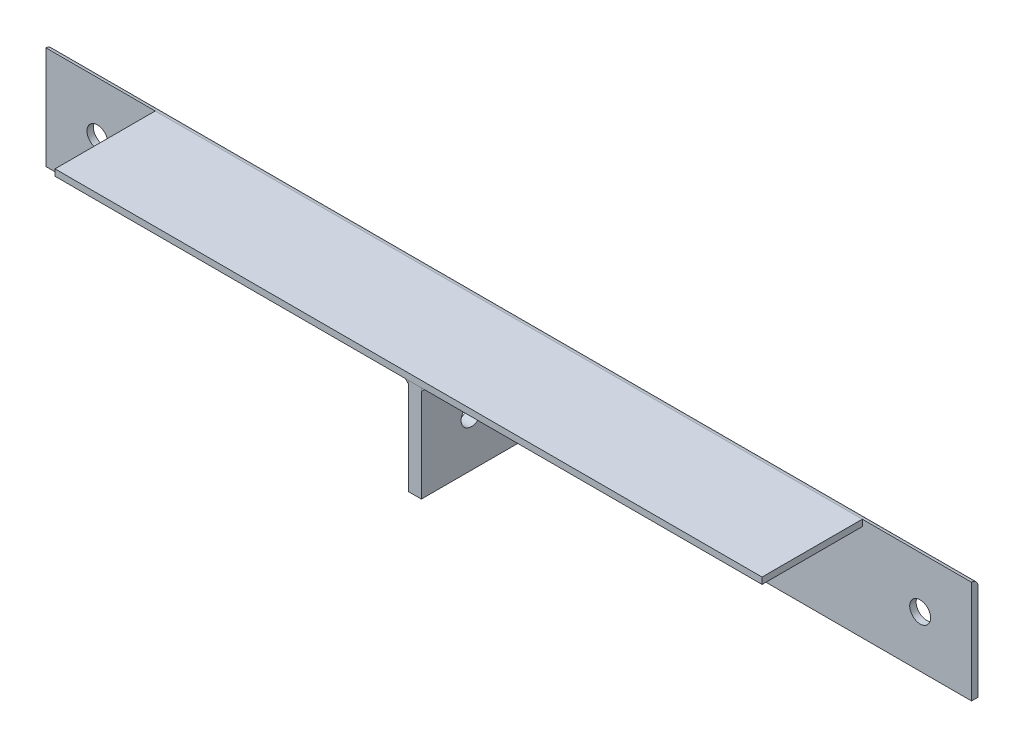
ISO-10303-21;
HEADER;
FILE_DESCRIPTION(('STEP AP214'),'2;1');
FILE_NAME('part.step','',(''),(''),'','','');
FILE_SCHEMA(('AUTOMOTIVE_DESIGN { 1 0 10303 214 1 1 1 1 }'));
ENDSEC;
DATA;
#1=APPLICATION_CONTEXT('core data for automotive mechanical design processes');
#2=APPLICATION_PROTOCOL_DEFINITION('international standard','automotive_design',2000,#1);
#3=PRODUCT_CONTEXT('',#1,'mechanical');
#4=PRODUCT('Part','Part','',(#3));
#5=PRODUCT_RELATED_PRODUCT_CATEGORY('part','',(#4));
#6=PRODUCT_DEFINITION_FORMATION('','',#4);
#7=PRODUCT_DEFINITION_CONTEXT('part definition',#1,'design');
#8=PRODUCT_DEFINITION('design','',#6,#7);
#9=PRODUCT_DEFINITION_SHAPE('','',#8);
#10=(LENGTH_UNIT() NAMED_UNIT(*) SI_UNIT(.MILLI.,.METRE.));
#11=(NAMED_UNIT(*) PLANE_ANGLE_UNIT() SI_UNIT($,.RADIAN.));
#12=(NAMED_UNIT(*) SI_UNIT($,.STERADIAN.) SOLID_ANGLE_UNIT());
#13=UNCERTAINTY_MEASURE_WITH_UNIT(LENGTH_MEASURE(1.E-05),#10,'distance_accuracy_value','');
#14=(GEOMETRIC_REPRESENTATION_CONTEXT(3) GLOBAL_UNCERTAINTY_ASSIGNED_CONTEXT((#13)) GLOBAL_UNIT_ASSIGNED_CONTEXT((#10,
#11,#12)) REPRESENTATION_CONTEXT('',''));
#15=CARTESIAN_POINT('',(0.,0.,0.));
#16=DIRECTION('',(0.,0.,1.));
#17=DIRECTION('',(1.,0.,0.));
#18=AXIS2_PLACEMENT_3D('',#15,#16,#17);
#19=CARTESIAN_POINT('',(0.,-101.6,6.35));
#20=DIRECTION('',(0.,1.,0.));
#21=DIRECTION('',(-1.,0.,0.));
#22=AXIS2_PLACEMENT_3D('',#19,#20,#21);
#23=PLANE('',#22);
#24=DIRECTION('',(1.,0.,0.));
#25=VECTOR('',#24,1.);
#26=CARTESIAN_POINT('',(0.,-101.6,6.35));
#27=LINE('',#26,#25);
#28=CARTESIAN_POINT('',(-444.5,-101.6,6.35));
#29=VERTEX_POINT('',#28);
#30=CARTESIAN_POINT('',(-441.325,-101.6,6.35));
#31=VERTEX_POINT('',#30);
#32=EDGE_CURVE('E47',#29,#31,#27,.T.);
#33=ORIENTED_EDGE('',*,*,#32,.T.);
#34=DIRECTION('',(0.707106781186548,0.,-0.707106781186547));
#35=VECTOR('',#34,1.);
#36=CARTESIAN_POINT('',(-220.6625,-101.6,-214.3125));
#37=LINE('',#36,#35);
#38=CARTESIAN_POINT('',(-444.5,-101.6,9.52499999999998));
#39=VERTEX_POINT('',#38);
#40=EDGE_CURVE('E117',#31,#39,#37,.F.);
#41=ORIENTED_EDGE('',*,*,#40,.T.);
#42=DIRECTION('',(0.,0.,-1.));
#43=VECTOR('',#42,1.);
#44=CARTESIAN_POINT('',(-444.5,-101.6,105.41));
#45=LINE('',#44,#43);
#46=EDGE_CURVE('E62',#39,#29,#45,.T.);
#47=ORIENTED_EDGE('',*,*,#46,.T.);
#48=EDGE_LOOP('',(#33,#41,#47));
#49=FACE_BOUND('',#48,.T.);
#50=ADVANCED_FACE('F43',(#49),#23,.F.);
#51=CARTESIAN_POINT('',(-107.95,-6.35,105.41));
#52=DIRECTION('',(0.,0.,-1.));
#53=DIRECTION('',(-1.,0.,0.));
#54=AXIS2_PLACEMENT_3D('',#51,#52,#53);
#55=PLANE('',#54);
#56=DIRECTION('',(-0.707106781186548,-0.707106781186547,0.));
#57=VECTOR('',#56,1.);
#58=CARTESIAN_POINT('',(-274.6375,160.3375,105.41));
#59=LINE('',#58,#57);
#60=CARTESIAN_POINT('',(-444.5,-9.52499999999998,105.41));
#61=VERTEX_POINT('',#60);
#62=CARTESIAN_POINT('',(-441.325,-6.35,105.41));
#63=VERTEX_POINT('',#62);
#64=EDGE_CURVE('E105',#61,#63,#59,.F.);
#65=ORIENTED_EDGE('',*,*,#64,.T.);
#66=DIRECTION('',(-1.,0.,0.));
#67=VECTOR('',#66,1.);
#68=CARTESIAN_POINT('',(-107.95,-6.35,105.41));
#69=LINE('',#68,#67);
#70=CARTESIAN_POINT('',(-444.5,-6.35,105.41));
#71=VERTEX_POINT('',#70);
#72=EDGE_CURVE('E114',#63,#71,#69,.T.);
#73=ORIENTED_EDGE('',*,*,#72,.T.);
#74=DIRECTION('',(0.,1.,0.));
#75=VECTOR('',#74,1.);
#76=CARTESIAN_POINT('',(-444.5,-6.35,105.41));
#77=LINE('',#76,#75);
#78=EDGE_CURVE('E12',#61,#71,#77,.T.);
#79=ORIENTED_EDGE('',*,*,#78,.F.);
#80=EDGE_LOOP('',(#65,#73,#79));
#81=FACE_BOUND('',#80,.T.);
#82=ADVANCED_FACE('F135',(#81),#55,.F.);
#83=CARTESIAN_POINT('',(-444.5,-101.6,9.52499999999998));
#84=DIRECTION('',(0.707106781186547,0.,0.707106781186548));
#85=DIRECTION('',(0.707106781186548,0.,-0.707106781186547));
#86=AXIS2_PLACEMENT_3D('',#83,#84,#85);
#87=PLANE('',#86);
#88=ORIENTED_EDGE('',*,*,#40,.F.);
#89=DIRECTION('',(0.,-1.,0.));
#90=VECTOR('',#89,1.);
#91=CARTESIAN_POINT('',(-441.325,-101.6,6.35));
#92=LINE('',#91,#90);
#93=CARTESIAN_POINT('',(-441.325,-6.34999999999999,6.35));
#94=VERTEX_POINT('',#93);
#95=EDGE_CURVE('E103',#94,#31,#92,.T.);
#96=ORIENTED_EDGE('',*,*,#95,.F.);
#97=DIRECTION('',(-0.577350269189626,-0.577350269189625,0.577350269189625));
#98=VECTOR('',#97,1.);
#99=CARTESIAN_POINT('',(-476.461666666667,-41.4866666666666,41.4866666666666));
#100=LINE('',#99,#98);
#101=CARTESIAN_POINT('',(-444.5,-9.52499999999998,9.52499999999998));
#102=VERTEX_POINT('',#101);
#103=EDGE_CURVE('E101',#102,#94,#100,.F.);
#104=ORIENTED_EDGE('',*,*,#103,.F.);
#105=DIRECTION('',(0.,1.,0.));
#106=VECTOR('',#105,1.);
#107=CARTESIAN_POINT('',(-444.5,-6.35,9.52499999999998));
#108=LINE('',#107,#106);
#109=EDGE_CURVE('E91',#39,#102,#108,.T.);
#110=ORIENTED_EDGE('',*,*,#109,.F.);
#111=EDGE_LOOP('',(#88,#96,#104,#110));
#112=FACE_BOUND('',#111,.T.);
#113=ADVANCED_FACE('F102',(#112),#87,.T.);
#114=CARTESIAN_POINT('',(-444.5,-9.52499999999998,105.41));
#115=DIRECTION('',(0.707106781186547,-0.707106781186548,0.));
#116=DIRECTION('',(0.707106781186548,0.707106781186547,0.));
#117=AXIS2_PLACEMENT_3D('',#114,#115,#116);
#118=PLANE('',#117);
#119=ORIENTED_EDGE('',*,*,#103,.T.);
#120=DIRECTION('',(0.,0.,-1.));
#121=VECTOR('',#120,1.);
#122=CARTESIAN_POINT('',(-441.325,-6.35,6.35));
#123=LINE('',#122,#121);
#124=EDGE_CURVE('E84',#63,#94,#123,.T.);
#125=ORIENTED_EDGE('',*,*,#124,.F.);
#126=ORIENTED_EDGE('',*,*,#64,.F.);
#127=DIRECTION('',(0.,0.,1.));
#128=VECTOR('',#127,1.);
#129=CARTESIAN_POINT('',(-444.5,-9.52499999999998,105.41));
#130=LINE('',#129,#128);
#131=EDGE_CURVE('E53',#102,#61,#130,.T.);
#132=ORIENTED_EDGE('',*,*,#131,.F.);
#133=EDGE_LOOP('',(#119,#125,#126,#132));
#134=FACE_BOUND('',#133,.T.);
#135=ADVANCED_FACE('F108',(#134),#118,.T.);
#136=CARTESIAN_POINT('',(0.,-101.6,6.35));
#137=DIRECTION('',(0.,0.,-1.));
#138=DIRECTION('',(-1.,0.,0.));
#139=AXIS2_PLACEMENT_3D('',#136,#137,#138);
#140=PLANE('',#139);
#141=ORIENTED_EDGE('',*,*,#95,.T.);
#142=ORIENTED_EDGE('',*,*,#32,.F.);
#143=DIRECTION('',(0.,1.,0.));
#144=VECTOR('',#143,1.);
#145=CARTESIAN_POINT('',(-444.5,-101.6,6.35));
#146=LINE('',#145,#144);
#147=CARTESIAN_POINT('',(-444.5,-6.35,6.35));
#148=VERTEX_POINT('',#147);
#149=EDGE_CURVE('E121',#29,#148,#146,.T.);
#150=ORIENTED_EDGE('',*,*,#149,.T.);
#151=DIRECTION('',(1.,0.,0.));
#152=VECTOR('',#151,1.);
#153=CARTESIAN_POINT('',(0.,-6.34999999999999,6.35));
#154=LINE('',#153,#152);
#155=EDGE_CURVE('E120',#148,#94,#154,.T.);
#156=ORIENTED_EDGE('',*,*,#155,.T.);
#157=EDGE_LOOP('',(#141,#142,#150,#156));
#158=FACE_BOUND('',#157,.T.);
#159=ADVANCED_FACE('F45',(#158),#140,.T.);
#160=CARTESIAN_POINT('',(-107.95,-6.35,105.41));
#161=DIRECTION('',(0.,1.,0.));
#162=DIRECTION('',(0.,0.,1.));
#163=AXIS2_PLACEMENT_3D('',#160,#161,#162);
#164=PLANE('',#163);
#165=ORIENTED_EDGE('',*,*,#124,.T.);
#166=ORIENTED_EDGE('',*,*,#155,.F.);
#167=DIRECTION('',(0.,0.,1.));
#168=VECTOR('',#167,1.);
#169=CARTESIAN_POINT('',(-444.5,-6.35,105.41));
#170=LINE('',#169,#168);
#171=EDGE_CURVE('E97',#148,#71,#170,.T.);
#172=ORIENTED_EDGE('',*,*,#171,.T.);
#173=ORIENTED_EDGE('',*,*,#72,.F.);
#174=EDGE_LOOP('',(#165,#166,#172,#173));
#175=FACE_BOUND('',#174,.T.);
#176=ADVANCED_FACE('F128',(#175),#164,.T.);
#177=CARTESIAN_POINT('',(-444.5,-101.6,105.41));
#178=DIRECTION('',(-1.,0.,0.));
#179=DIRECTION('',(0.,0.,1.));
#180=AXIS2_PLACEMENT_3D('',#177,#178,#179);
#181=PLANE('',#180);
#182=ORIENTED_EDGE('',*,*,#109,.T.);
#183=ORIENTED_EDGE('',*,*,#131,.T.);
#184=ORIENTED_EDGE('',*,*,#78,.T.);
#185=ORIENTED_EDGE('',*,*,#171,.F.);
#186=ORIENTED_EDGE('',*,*,#149,.F.);
#187=ORIENTED_EDGE('',*,*,#46,.F.);
#188=EDGE_LOOP('',(#182,#183,#184,#185,#186,#187));
#189=FACE_BOUND('',#188,.T.);
#190=ADVANCED_FACE('F93',(#189),#181,.T.);
#191=CLOSED_SHELL('',(#50,#82,#113,#135,#159,#176,#190));
#192=MANIFOLD_SOLID_BREP('B2',#191);
#193=CARTESIAN_POINT('',(-457.2,-9.52499999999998,105.41));
#194=DIRECTION('',(-0.707106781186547,-0.707106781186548,0.));
#195=DIRECTION('',(0.707106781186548,-0.707106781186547,0.));
#196=AXIS2_PLACEMENT_3D('',#193,#194,#195);
#197=PLANE('',#196);
#198=DIRECTION('',(-0.707106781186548,0.707106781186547,0.));
#199=VECTOR('',#198,1.);
#200=CARTESIAN_POINT('',(-284.1625,-182.5625,105.41));
#201=LINE('',#200,#199);
#202=CARTESIAN_POINT('',(-460.375,-6.35,105.41));
#203=VERTEX_POINT('',#202);
#204=CARTESIAN_POINT('',(-457.2,-9.52499999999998,105.41));
#205=VERTEX_POINT('',#204);
#206=EDGE_CURVE('E205',#203,#205,#201,.F.);
#207=ORIENTED_EDGE('',*,*,#206,.F.);
#208=DIRECTION('',(0.,0.,1.));
#209=VECTOR('',#208,1.);
#210=CARTESIAN_POINT('',(-460.375,-6.35,105.41));
#211=LINE('',#210,#209);
#212=CARTESIAN_POINT('',(-460.375,-6.34999999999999,6.35));
#213=VERTEX_POINT('',#212);
#214=EDGE_CURVE('E266',#213,#203,#211,.T.);
#215=ORIENTED_EDGE('',*,*,#214,.F.);
#216=DIRECTION('',(-0.577350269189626,0.577350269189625,-0.577350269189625));
#217=VECTOR('',#216,1.);
#218=CARTESIAN_POINT('',(-425.238333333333,-41.4866666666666,41.4866666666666));
#219=LINE('',#218,#217);
#220=CARTESIAN_POINT('',(-457.2,-9.52499999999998,9.52499999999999));
#221=VERTEX_POINT('',#220);
#222=EDGE_CURVE('E200',#213,#221,#219,.F.);
#223=ORIENTED_EDGE('',*,*,#222,.T.);
#224=DIRECTION('',(0.,0.,-1.));
#225=VECTOR('',#224,1.);
#226=CARTESIAN_POINT('',(-457.2,-9.52499999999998,6.35));
#227=LINE('',#226,#225);
#228=EDGE_CURVE('E264',#205,#221,#227,.T.);
#229=ORIENTED_EDGE('',*,*,#228,.F.);
#230=EDGE_LOOP('',(#207,#215,#223,#229));
#231=FACE_BOUND('',#230,.T.);
#232=ADVANCED_FACE('F196',(#231),#197,.T.);
#233=CARTESIAN_POINT('',(-457.2,-101.6,9.52499999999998));
#234=DIRECTION('',(-0.707106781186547,0.,0.707106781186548));
#235=DIRECTION('',(0.707106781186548,0.,0.707106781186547));
#236=AXIS2_PLACEMENT_3D('',#233,#234,#235);
#237=PLANE('',#236);
#238=DIRECTION('',(0.707106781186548,0.,0.707106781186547));
#239=VECTOR('',#238,1.);
#240=CARTESIAN_POINT('',(-230.1875,-101.6,236.5375));
#241=LINE('',#240,#239);
#242=CARTESIAN_POINT('',(-457.2,-101.6,9.52499999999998));
#243=VERTEX_POINT('',#242);
#244=CARTESIAN_POINT('',(-460.375,-101.6,6.35));
#245=VERTEX_POINT('',#244);
#246=EDGE_CURVE('E41',#243,#245,#241,.F.);
#247=ORIENTED_EDGE('',*,*,#246,.F.);
#248=DIRECTION('',(0.,-1.,0.));
#249=VECTOR('',#248,1.);
#250=CARTESIAN_POINT('',(-457.2,-101.6,9.52499999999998));
#251=LINE('',#250,#249);
#252=EDGE_CURVE('E257',#221,#243,#251,.T.);
#253=ORIENTED_EDGE('',*,*,#252,.F.);
#254=ORIENTED_EDGE('',*,*,#222,.F.);
#255=DIRECTION('',(0.,1.,0.));
#256=VECTOR('',#255,1.);
#257=CARTESIAN_POINT('',(-460.375,-6.35,6.35));
#258=LINE('',#257,#256);
#259=EDGE_CURVE('E268',#245,#213,#258,.T.);
#260=ORIENTED_EDGE('',*,*,#259,.F.);
#261=EDGE_LOOP('',(#247,#253,#254,#260));
#262=FACE_BOUND('',#261,.T.);
#263=ADVANCED_FACE('F198',(#262),#237,.T.);
#264=CARTESIAN_POINT('',(-107.95,-6.35,105.41));
#265=DIRECTION('',(0.,0.,-1.));
#266=DIRECTION('',(-1.,0.,0.));
#267=AXIS2_PLACEMENT_3D('',#264,#265,#266);
#268=PLANE('',#267);
#269=DIRECTION('',(1.,0.,0.));
#270=VECTOR('',#269,1.);
#271=CARTESIAN_POINT('',(-107.95,-6.35,105.41));
#272=LINE('',#271,#270);
#273=CARTESIAN_POINT('',(-457.2,-6.35,105.41));
#274=VERTEX_POINT('',#273);
#275=EDGE_CURVE('E245',#203,#274,#272,.T.);
#276=ORIENTED_EDGE('',*,*,#275,.F.);
#277=ORIENTED_EDGE('',*,*,#206,.T.);
#278=DIRECTION('',(0.,1.,0.));
#279=VECTOR('',#278,1.);
#280=CARTESIAN_POINT('',(-457.2,-101.6,105.41));
#281=LINE('',#280,#279);
#282=EDGE_CURVE('E212',#205,#274,#281,.T.);
#283=ORIENTED_EDGE('',*,*,#282,.T.);
#284=EDGE_LOOP('',(#276,#277,#283));
#285=FACE_BOUND('',#284,.T.);
#286=ADVANCED_FACE('F274',(#285),#268,.F.);
#287=CARTESIAN_POINT('',(0.,-101.6,6.35));
#288=DIRECTION('',(0.,1.,0.));
#289=DIRECTION('',(-1.,0.,0.));
#290=AXIS2_PLACEMENT_3D('',#287,#288,#289);
#291=PLANE('',#290);
#292=DIRECTION('',(1.,0.,0.));
#293=VECTOR('',#292,1.);
#294=CARTESIAN_POINT('',(0.,-101.6,6.35));
#295=LINE('',#294,#293);
#296=CARTESIAN_POINT('',(-457.2,-101.6,6.35));
#297=VERTEX_POINT('',#296);
#298=EDGE_CURVE('E220',#245,#297,#295,.T.);
#299=ORIENTED_EDGE('',*,*,#298,.T.);
#300=DIRECTION('',(0.,0.,-1.));
#301=VECTOR('',#300,1.);
#302=CARTESIAN_POINT('',(-457.2,-101.6,6.35));
#303=LINE('',#302,#301);
#304=EDGE_CURVE('E241',#243,#297,#303,.T.);
#305=ORIENTED_EDGE('',*,*,#304,.F.);
#306=ORIENTED_EDGE('',*,*,#246,.T.);
#307=EDGE_LOOP('',(#299,#305,#306));
#308=FACE_BOUND('',#307,.T.);
#309=ADVANCED_FACE('F239',(#308),#291,.F.);
#310=CARTESIAN_POINT('',(-457.2,-101.6,105.41));
#311=DIRECTION('',(1.,0.,0.));
#312=DIRECTION('',(0.,0.,-1.));
#313=AXIS2_PLACEMENT_3D('',#310,#311,#312);
#314=PLANE('',#313);
#315=ORIENTED_EDGE('',*,*,#252,.T.);
#316=ORIENTED_EDGE('',*,*,#304,.T.);
#317=DIRECTION('',(0.,-1.,0.));
#318=VECTOR('',#317,1.);
#319=CARTESIAN_POINT('',(-457.2,-101.6,6.35));
#320=LINE('',#319,#318);
#321=CARTESIAN_POINT('',(-457.2,-6.35,6.35));
#322=VERTEX_POINT('',#321);
#323=EDGE_CURVE('E248',#322,#297,#320,.T.);
#324=ORIENTED_EDGE('',*,*,#323,.F.);
#325=DIRECTION('',(0.,0.,-1.));
#326=VECTOR('',#325,1.);
#327=CARTESIAN_POINT('',(-457.2,-6.35,105.41));
#328=LINE('',#327,#326);
#329=EDGE_CURVE('E253',#274,#322,#328,.T.);
#330=ORIENTED_EDGE('',*,*,#329,.F.);
#331=ORIENTED_EDGE('',*,*,#282,.F.);
#332=ORIENTED_EDGE('',*,*,#228,.T.);
#333=EDGE_LOOP('',(#315,#316,#324,#330,#331,#332));
#334=FACE_BOUND('',#333,.T.);
#335=ADVANCED_FACE('F255',(#334),#314,.T.);
#336=CARTESIAN_POINT('',(-107.95,-6.35,105.41));
#337=DIRECTION('',(0.,1.,0.));
#338=DIRECTION('',(0.,0.,1.));
#339=AXIS2_PLACEMENT_3D('',#336,#337,#338);
#340=PLANE('',#339);
#341=ORIENTED_EDGE('',*,*,#214,.T.);
#342=ORIENTED_EDGE('',*,*,#275,.T.);
#343=ORIENTED_EDGE('',*,*,#329,.T.);
#344=DIRECTION('',(1.,0.,0.));
#345=VECTOR('',#344,1.);
#346=CARTESIAN_POINT('',(0.,-6.34999999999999,6.35));
#347=LINE('',#346,#345);
#348=EDGE_CURVE('E251',#213,#322,#347,.T.);
#349=ORIENTED_EDGE('',*,*,#348,.F.);
#350=EDGE_LOOP('',(#341,#342,#343,#349));
#351=FACE_BOUND('',#350,.T.);
#352=ADVANCED_FACE('F280',(#351),#340,.T.);
#353=CARTESIAN_POINT('',(0.,-101.6,6.35));
#354=DIRECTION('',(0.,0.,-1.));
#355=DIRECTION('',(-1.,0.,0.));
#356=AXIS2_PLACEMENT_3D('',#353,#354,#355);
#357=PLANE('',#356);
#358=ORIENTED_EDGE('',*,*,#259,.T.);
#359=ORIENTED_EDGE('',*,*,#348,.T.);
#360=ORIENTED_EDGE('',*,*,#323,.T.);
#361=ORIENTED_EDGE('',*,*,#298,.F.);
#362=EDGE_LOOP('',(#358,#359,#360,#361));
#363=FACE_BOUND('',#362,.T.);
#364=ADVANCED_FACE('F249',(#363),#357,.T.);
#365=CLOSED_SHELL('',(#232,#263,#286,#309,#335,#352,#364));
#366=MANIFOLD_SOLID_BREP('B6',#365);
#367=CARTESIAN_POINT('',(-457.2,-101.6,105.41));
#368=DIRECTION('',(1.,0.,0.));
#369=DIRECTION('',(0.,0.,-1.));
#370=AXIS2_PLACEMENT_3D('',#367,#368,#369);
#371=PLANE('',#370);
#372=CARTESIAN_POINT('',(-457.2,-53.975,55.88));
#373=DIRECTION('',(-1.,0.,0.));
#374=DIRECTION('',(0.,0.,1.));
#375=AXIS2_PLACEMENT_3D('',#372,#373,#374);
#376=CIRCLE('',#375,10.31875);
#377=CARTESIAN_POINT('',(-457.2,-53.975,66.19875));
#378=VERTEX_POINT('',#377);
#379=EDGE_CURVE('E428',#378,#378,#376,.T.);
#380=ORIENTED_EDGE('',*,*,#379,.F.);
#381=EDGE_LOOP('',(#380));
#382=FACE_BOUND('',#381,.T.);
#383=DIRECTION('',(0.,-1.,0.));
#384=VECTOR('',#383,1.);
#385=CARTESIAN_POINT('',(-457.2,-101.6,6.35));
#386=LINE('',#385,#384);
#387=CARTESIAN_POINT('',(-457.2,-6.35,6.35));
#388=VERTEX_POINT('',#387);
#389=CARTESIAN_POINT('',(-457.2,-101.6,6.35));
#390=VERTEX_POINT('',#389);
#391=EDGE_CURVE('E412',#388,#390,#386,.T.);
#392=ORIENTED_EDGE('',*,*,#391,.T.);
#393=DIRECTION('',(0.,0.,-1.));
#394=VECTOR('',#393,1.);
#395=CARTESIAN_POINT('',(-457.2,-101.6,105.41));
#396=LINE('',#395,#394);
#397=CARTESIAN_POINT('',(-457.2,-101.6,105.41));
#398=VERTEX_POINT('',#397);
#399=EDGE_CURVE('E194',#398,#390,#396,.T.);
#400=ORIENTED_EDGE('',*,*,#399,.F.);
#401=DIRECTION('',(0.,-1.,0.));
#402=VECTOR('',#401,1.);
#403=CARTESIAN_POINT('',(-457.2,-101.6,105.41));
#404=LINE('',#403,#402);
#405=CARTESIAN_POINT('',(-457.2,-6.35,105.41));
#406=VERTEX_POINT('',#405);
#407=EDGE_CURVE('E400',#406,#398,#404,.T.);
#408=ORIENTED_EDGE('',*,*,#407,.F.);
#409=DIRECTION('',(0.,0.,-1.));
#410=VECTOR('',#409,1.);
#411=CARTESIAN_POINT('',(-457.2,-6.35,105.41));
#412=LINE('',#411,#410);
#413=EDGE_CURVE('E408',#406,#388,#412,.T.);
#414=ORIENTED_EDGE('',*,*,#413,.T.);
#415=EDGE_LOOP('',(#392,#400,#408,#414));
#416=FACE_BOUND('',#415,.T.);
#417=ADVANCED_FACE('F349',(#382,#416),#371,.F.);
#418=CARTESIAN_POINT('',(-457.2,-101.6,105.41));
#419=DIRECTION('',(0.,1.,0.));
#420=DIRECTION('',(0.,0.,1.));
#421=AXIS2_PLACEMENT_3D('',#418,#419,#420);
#422=PLANE('',#421);
#423=DIRECTION('',(1.,0.,0.));
#424=VECTOR('',#423,1.);
#425=CARTESIAN_POINT('',(-457.2,-101.6,6.35));
#426=LINE('',#425,#424);
#427=CARTESIAN_POINT('',(-444.5,-101.6,6.35));
#428=VERTEX_POINT('',#427);
#429=EDGE_CURVE('E404',#390,#428,#426,.T.);
#430=ORIENTED_EDGE('',*,*,#429,.T.);
#431=DIRECTION('',(0.,0.,-1.));
#432=VECTOR('',#431,1.);
#433=CARTESIAN_POINT('',(-444.5,-101.6,105.41));
#434=LINE('',#433,#432);
#435=CARTESIAN_POINT('',(-444.5,-101.6,105.41));
#436=VERTEX_POINT('',#435);
#437=EDGE_CURVE('E357',#436,#428,#434,.T.);
#438=ORIENTED_EDGE('',*,*,#437,.F.);
#439=DIRECTION('',(1.,0.,0.));
#440=VECTOR('',#439,1.);
#441=CARTESIAN_POINT('',(-457.2,-101.6,105.41));
#442=LINE('',#441,#440);
#443=EDGE_CURVE('E395',#398,#436,#442,.T.);
#444=ORIENTED_EDGE('',*,*,#443,.F.);
#445=ORIENTED_EDGE('',*,*,#399,.T.);
#446=EDGE_LOOP('',(#430,#438,#444,#445));
#447=FACE_BOUND('',#446,.T.);
#448=ADVANCED_FACE('F403',(#447),#422,.F.);
#449=CARTESIAN_POINT('',(-444.5,-101.6,105.41));
#450=DIRECTION('',(-1.,0.,0.));
#451=DIRECTION('',(0.,0.,1.));
#452=AXIS2_PLACEMENT_3D('',#449,#450,#451);
#453=PLANE('',#452);
#454=CARTESIAN_POINT('',(-444.5,-53.975,55.88));
#455=DIRECTION('',(-1.,0.,0.));
#456=DIRECTION('',(0.,0.,1.));
#457=AXIS2_PLACEMENT_3D('',#454,#455,#456);
#458=CIRCLE('',#457,10.31875);
#459=CARTESIAN_POINT('',(-444.5,-53.975,66.19875));
#460=VERTEX_POINT('',#459);
#461=EDGE_CURVE('E415',#460,#460,#458,.F.);
#462=ORIENTED_EDGE('',*,*,#461,.F.);
#463=EDGE_LOOP('',(#462));
#464=FACE_BOUND('',#463,.T.);
#465=DIRECTION('',(0.,1.,0.));
#466=VECTOR('',#465,1.);
#467=CARTESIAN_POINT('',(-444.5,-101.6,6.35));
#468=LINE('',#467,#466);
#469=CARTESIAN_POINT('',(-444.5,-6.35,6.35));
#470=VERTEX_POINT('',#469);
#471=EDGE_CURVE('E382',#428,#470,#468,.T.);
#472=ORIENTED_EDGE('',*,*,#471,.T.);
#473=DIRECTION('',(0.,0.,-1.));
#474=VECTOR('',#473,1.);
#475=CARTESIAN_POINT('',(-444.5,-6.35,105.41));
#476=LINE('',#475,#474);
#477=CARTESIAN_POINT('',(-444.5,-6.35,105.41));
#478=VERTEX_POINT('',#477);
#479=EDGE_CURVE('E405',#478,#470,#476,.T.);
#480=ORIENTED_EDGE('',*,*,#479,.F.);
#481=DIRECTION('',(0.,1.,0.));
#482=VECTOR('',#481,1.);
#483=CARTESIAN_POINT('',(-444.5,-101.6,105.41));
#484=LINE('',#483,#482);
#485=EDGE_CURVE('E398',#436,#478,#484,.T.);
#486=ORIENTED_EDGE('',*,*,#485,.F.);
#487=ORIENTED_EDGE('',*,*,#437,.T.);
#488=EDGE_LOOP('',(#472,#480,#486,#487));
#489=FACE_BOUND('',#488,.T.);
#490=ADVANCED_FACE('F406',(#464,#489),#453,.F.);
#491=CARTESIAN_POINT('',(-457.2,-6.35,105.41));
#492=DIRECTION('',(0.,-1.,0.));
#493=DIRECTION('',(0.,0.,-1.));
#494=AXIS2_PLACEMENT_3D('',#491,#492,#493);
#495=PLANE('',#494);
#496=DIRECTION('',(-1.,0.,0.));
#497=VECTOR('',#496,1.);
#498=CARTESIAN_POINT('',(-457.2,-6.35,6.35));
#499=LINE('',#498,#497);
#500=EDGE_CURVE('E388',#470,#388,#499,.T.);
#501=ORIENTED_EDGE('',*,*,#500,.T.);
#502=ORIENTED_EDGE('',*,*,#413,.F.);
#503=DIRECTION('',(-1.,0.,0.));
#504=VECTOR('',#503,1.);
#505=CARTESIAN_POINT('',(-457.2,-6.35,105.41));
#506=LINE('',#505,#504);
#507=EDGE_CURVE('E365',#478,#406,#506,.T.);
#508=ORIENTED_EDGE('',*,*,#507,.F.);
#509=ORIENTED_EDGE('',*,*,#479,.T.);
#510=EDGE_LOOP('',(#501,#502,#508,#509));
#511=FACE_BOUND('',#510,.T.);
#512=ADVANCED_FACE('F420',(#511),#495,.F.);
#513=CARTESIAN_POINT('',(-457.2,-6.35,105.41));
#514=DIRECTION('',(0.,0.,-1.));
#515=DIRECTION('',(-1.,0.,0.));
#516=AXIS2_PLACEMENT_3D('',#513,#514,#515);
#517=PLANE('',#516);
#518=ORIENTED_EDGE('',*,*,#407,.T.);
#519=ORIENTED_EDGE('',*,*,#443,.T.);
#520=ORIENTED_EDGE('',*,*,#485,.T.);
#521=ORIENTED_EDGE('',*,*,#507,.T.);
#522=EDGE_LOOP('',(#518,#519,#520,#521));
#523=FACE_BOUND('',#522,.T.);
#524=ADVANCED_FACE('F396',(#523),#517,.F.);
#525=CARTESIAN_POINT('',(-457.2,-6.35,6.35));
#526=DIRECTION('',(0.,0.,-1.));
#527=DIRECTION('',(-1.,0.,0.));
#528=AXIS2_PLACEMENT_3D('',#525,#526,#527);
#529=PLANE('',#528);
#530=ORIENTED_EDGE('',*,*,#391,.F.);
#531=ORIENTED_EDGE('',*,*,#500,.F.);
#532=ORIENTED_EDGE('',*,*,#471,.F.);
#533=ORIENTED_EDGE('',*,*,#429,.F.);
#534=EDGE_LOOP('',(#530,#531,#532,#533));
#535=FACE_BOUND('',#534,.T.);
#536=ADVANCED_FACE('F423',(#535),#529,.T.);
#537=CARTESIAN_POINT('',(0.00102499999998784,-53.975,55.88));
#538=DIRECTION('',(-1.,0.,0.));
#539=DIRECTION('',(0.,0.,1.));
#540=AXIS2_PLACEMENT_3D('',#537,#538,#539);
#541=CYLINDRICAL_SURFACE('',#540,10.31875);
#542=ORIENTED_EDGE('',*,*,#379,.T.);
#543=EDGE_LOOP('',(#542));
#544=FACE_BOUND('',#543,.T.);
#545=ORIENTED_EDGE('',*,*,#461,.T.);
#546=EDGE_LOOP('',(#545));
#547=FACE_BOUND('',#546,.T.);
#548=ADVANCED_FACE('F432',(#544,#547),#541,.F.);
#549=CLOSED_SHELL('',(#417,#448,#490,#512,#524,#536,#548));
#550=MANIFOLD_SOLID_BREP('B35',#549);
#551=CARTESIAN_POINT('',(0.,-101.6,6.35));
#552=DIRECTION('',(0.,0.,-1.));
#553=DIRECTION('',(-1.,0.,0.));
#554=AXIS2_PLACEMENT_3D('',#551,#552,#553);
#555=PLANE('',#554);
#556=CARTESIAN_POINT('',(-863.6,-50.8,6.35));
#557=DIRECTION('',(0.,0.,1.));
#558=DIRECTION('',(1.,0.,0.));
#559=AXIS2_PLACEMENT_3D('',#556,#557,#558);
#560=CIRCLE('',#559,10.31875);
#561=CARTESIAN_POINT('',(-853.28125,-50.8,6.35));
#562=VERTEX_POINT('',#561);
#563=EDGE_CURVE('E611',#562,#562,#560,.T.);
#564=ORIENTED_EDGE('',*,*,#563,.F.);
#565=EDGE_LOOP('',(#564));
#566=FACE_BOUND('',#565,.T.);
#567=CARTESIAN_POINT('',(-50.8,-50.8,6.35));
#568=DIRECTION('',(0.,0.,1.));
#569=DIRECTION('',(1.,0.,0.));
#570=AXIS2_PLACEMENT_3D('',#567,#568,#569);
#571=CIRCLE('',#570,10.31875);
#572=CARTESIAN_POINT('',(-40.48125,-50.8,6.35));
#573=VERTEX_POINT('',#572);
#574=EDGE_CURVE('E583',#573,#573,#571,.T.);
#575=ORIENTED_EDGE('',*,*,#574,.F.);
#576=EDGE_LOOP('',(#575));
#577=FACE_BOUND('',#576,.T.);
#578=DIRECTION('',(0.,1.,0.));
#579=VECTOR('',#578,1.);
#580=CARTESIAN_POINT('',(-107.95,0.,6.35));
#581=LINE('',#580,#579);
#582=CARTESIAN_POINT('',(-107.95,-6.35,6.35));
#583=VERTEX_POINT('',#582);
#584=CARTESIAN_POINT('',(-107.95,0.,6.35));
#585=VERTEX_POINT('',#584);
#586=EDGE_CURVE('E582',#583,#585,#581,.T.);
#587=ORIENTED_EDGE('',*,*,#586,.F.);
#588=DIRECTION('',(1.,0.,0.));
#589=VECTOR('',#588,1.);
#590=CARTESIAN_POINT('',(-107.95,-6.35,6.35));
#591=LINE('',#590,#589);
#592=CARTESIAN_POINT('',(-806.45,-6.35,6.35));
#593=VERTEX_POINT('',#592);
#594=EDGE_CURVE('E579',#593,#583,#591,.T.);
#595=ORIENTED_EDGE('',*,*,#594,.F.);
#596=DIRECTION('',(0.,-1.,0.));
#597=VECTOR('',#596,1.);
#598=CARTESIAN_POINT('',(-806.45,0.,6.35));
#599=LINE('',#598,#597);
#600=CARTESIAN_POINT('',(-806.45,0.,6.35));
#601=VERTEX_POINT('',#600);
#602=EDGE_CURVE('E597',#601,#593,#599,.T.);
#603=ORIENTED_EDGE('',*,*,#602,.F.);
#604=DIRECTION('',(-1.,0.,0.));
#605=VECTOR('',#604,1.);
#606=CARTESIAN_POINT('',(0.,0.,6.35));
#607=LINE('',#606,#605);
#608=CARTESIAN_POINT('',(-914.4,-1.11978004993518E-13,6.35));
#609=VERTEX_POINT('',#608);
#610=EDGE_CURVE('E622',#601,#609,#607,.T.);
#611=ORIENTED_EDGE('',*,*,#610,.T.);
#612=DIRECTION('',(0.,-1.,0.));
#613=VECTOR('',#612,1.);
#614=CARTESIAN_POINT('',(-914.4,-1.11978004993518E-13,6.35));
#615=LINE('',#614,#613);
#616=CARTESIAN_POINT('',(-914.4,-101.6,6.35));
#617=VERTEX_POINT('',#616);
#618=EDGE_CURVE('E626',#609,#617,#615,.T.);
#619=ORIENTED_EDGE('',*,*,#618,.T.);
#620=DIRECTION('',(1.,0.,0.));
#621=VECTOR('',#620,1.);
#622=CARTESIAN_POINT('',(0.,-101.6,6.35));
#623=LINE('',#622,#621);
#624=CARTESIAN_POINT('',(0.,-101.6,6.35));
#625=VERTEX_POINT('',#624);
#626=EDGE_CURVE('E641',#617,#625,#623,.T.);
#627=ORIENTED_EDGE('',*,*,#626,.T.);
#628=DIRECTION('',(0.,1.,0.));
#629=VECTOR('',#628,1.);
#630=CARTESIAN_POINT('',(0.,0.,6.35));
#631=LINE('',#630,#629);
#632=CARTESIAN_POINT('',(0.,0.,6.35));
#633=VERTEX_POINT('',#632);
#634=EDGE_CURVE('E619',#625,#633,#631,.T.);
#635=ORIENTED_EDGE('',*,*,#634,.T.);
#636=EDGE_CURVE('E632',#633,#585,#607,.T.);
#637=ORIENTED_EDGE('',*,*,#636,.T.);
#638=EDGE_LOOP('',(#587,#595,#603,#611,#619,#627,#635,#637));
#639=FACE_BOUND('',#638,.T.);
#640=ADVANCED_FACE('F494',(#566,#577,#639),#555,.F.);
#641=CARTESIAN_POINT('',(0.,0.,6.35));
#642=DIRECTION('',(-1.,0.,0.));
#643=DIRECTION('',(0.,0.,1.));
#644=AXIS2_PLACEMENT_3D('',#641,#642,#643);
#645=PLANE('',#644);
#646=DIRECTION('',(0.,1.,0.));
#647=VECTOR('',#646,1.);
#648=CARTESIAN_POINT('',(0.,0.,0.));
#649=LINE('',#648,#647);
#650=CARTESIAN_POINT('',(0.,-101.6,0.));
#651=VERTEX_POINT('',#650);
#652=CARTESIAN_POINT('',(0.,-6.35,0.));
#653=VERTEX_POINT('',#652);
#654=EDGE_CURVE('E616',#651,#653,#649,.T.);
#655=ORIENTED_EDGE('',*,*,#654,.T.);
#656=CARTESIAN_POINT('',(0.,-6.35,6.35));
#657=DIRECTION('',(-1.,0.,0.));
#658=DIRECTION('',(0.,0.,1.));
#659=AXIS2_PLACEMENT_3D('',#656,#657,#658);
#660=CIRCLE('',#659,6.35);
#661=EDGE_CURVE('E347',#653,#633,#660,.F.);
#662=ORIENTED_EDGE('',*,*,#661,.T.);
#663=ORIENTED_EDGE('',*,*,#634,.F.);
#664=DIRECTION('',(0.,0.,-1.));
#665=VECTOR('',#664,1.);
#666=CARTESIAN_POINT('',(0.,-101.6,6.35));
#667=LINE('',#666,#665);
#668=EDGE_CURVE('E638',#625,#651,#667,.T.);
#669=ORIENTED_EDGE('',*,*,#668,.T.);
#670=EDGE_LOOP('',(#655,#662,#663,#669));
#671=FACE_BOUND('',#670,.T.);
#672=ADVANCED_FACE('F657',(#671),#645,.F.);
#673=CARTESIAN_POINT('',(0.,0.,6.35));
#674=DIRECTION('',(0.,-1.,0.));
#675=DIRECTION('',(1.,0.,0.));
#676=AXIS2_PLACEMENT_3D('',#673,#674,#675);
#677=PLANE('',#676);
#678=DIRECTION('',(0.,0.,-1.));
#679=VECTOR('',#678,1.);
#680=CARTESIAN_POINT('',(-107.95,0.,105.41));
#681=LINE('',#680,#679);
#682=CARTESIAN_POINT('',(-107.95,0.,105.41));
#683=VERTEX_POINT('',#682);
#684=EDGE_CURVE('E563',#683,#585,#681,.T.);
#685=ORIENTED_EDGE('',*,*,#684,.T.);
#686=DIRECTION('',(-1.,0.,0.));
#687=VECTOR('',#686,1.);
#688=CARTESIAN_POINT('',(-914.4,-1.11978004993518E-13,6.35));
#689=LINE('',#688,#687);
#690=EDGE_CURVE('E598',#585,#601,#689,.T.);
#691=ORIENTED_EDGE('',*,*,#690,.T.);
#692=DIRECTION('',(0.,0.,-1.));
#693=VECTOR('',#692,1.);
#694=CARTESIAN_POINT('',(-806.45,0.,105.41));
#695=LINE('',#694,#693);
#696=CARTESIAN_POINT('',(-806.45,0.,105.41));
#697=VERTEX_POINT('',#696);
#698=EDGE_CURVE('E566',#697,#601,#695,.T.);
#699=ORIENTED_EDGE('',*,*,#698,.F.);
#700=DIRECTION('',(-1.,0.,0.));
#701=VECTOR('',#700,1.);
#702=CARTESIAN_POINT('',(-107.95,0.,105.41));
#703=LINE('',#702,#701);
#704=EDGE_CURVE('E559',#683,#697,#703,.T.);
#705=ORIENTED_EDGE('',*,*,#704,.F.);
#706=EDGE_LOOP('',(#685,#691,#699,#705));
#707=FACE_BOUND('',#706,.T.);
#708=ADVANCED_FACE('F561',(#707),#677,.F.);
#709=CARTESIAN_POINT('',(-914.4,-1.11978004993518E-13,6.35));
#710=DIRECTION('',(1.,0.,0.));
#711=DIRECTION('',(0.,0.,-1.));
#712=AXIS2_PLACEMENT_3D('',#709,#710,#711);
#713=PLANE('',#712);
#714=ORIENTED_EDGE('',*,*,#618,.F.);
#715=CARTESIAN_POINT('',(-914.4,-6.35000000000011,6.35));
#716=DIRECTION('',(1.,0.,0.));
#717=DIRECTION('',(0.,0.,-1.));
#718=AXIS2_PLACEMENT_3D('',#715,#716,#717);
#719=CIRCLE('',#718,6.35);
#720=CARTESIAN_POINT('',(-914.4,-6.35000000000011,0.));
#721=VERTEX_POINT('',#720);
#722=EDGE_CURVE('E516',#609,#721,#719,.F.);
#723=ORIENTED_EDGE('',*,*,#722,.T.);
#724=DIRECTION('',(0.,-1.,0.));
#725=VECTOR('',#724,1.);
#726=CARTESIAN_POINT('',(-914.4,-1.11978004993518E-13,0.));
#727=LINE('',#726,#725);
#728=CARTESIAN_POINT('',(-914.4,-101.6,0.));
#729=VERTEX_POINT('',#728);
#730=EDGE_CURVE('E643',#721,#729,#727,.T.);
#731=ORIENTED_EDGE('',*,*,#730,.T.);
#732=DIRECTION('',(0.,0.,-1.));
#733=VECTOR('',#732,1.);
#734=CARTESIAN_POINT('',(-914.4,-101.6,6.35));
#735=LINE('',#734,#733);
#736=EDGE_CURVE('E635',#617,#729,#735,.T.);
#737=ORIENTED_EDGE('',*,*,#736,.F.);
#738=EDGE_LOOP('',(#714,#723,#731,#737));
#739=FACE_BOUND('',#738,.T.);
#740=ADVANCED_FACE('F651',(#739),#713,.F.);
#741=CARTESIAN_POINT('',(0.,-101.6,6.35));
#742=DIRECTION('',(0.,1.,0.));
#743=DIRECTION('',(-1.,0.,0.));
#744=AXIS2_PLACEMENT_3D('',#741,#742,#743);
#745=PLANE('',#744);
#746=DIRECTION('',(1.,0.,0.));
#747=VECTOR('',#746,1.);
#748=CARTESIAN_POINT('',(0.,-101.6,0.));
#749=LINE('',#748,#747);
#750=EDGE_CURVE('E623',#729,#651,#749,.T.);
#751=ORIENTED_EDGE('',*,*,#750,.T.);
#752=ORIENTED_EDGE('',*,*,#668,.F.);
#753=ORIENTED_EDGE('',*,*,#626,.F.);
#754=ORIENTED_EDGE('',*,*,#736,.T.);
#755=EDGE_LOOP('',(#751,#752,#753,#754));
#756=FACE_BOUND('',#755,.T.);
#757=ADVANCED_FACE('F654',(#756),#745,.F.);
#758=CARTESIAN_POINT('',(0.,-101.6,0.));
#759=DIRECTION('',(0.,0.,-1.));
#760=DIRECTION('',(-1.,0.,0.));
#761=AXIS2_PLACEMENT_3D('',#758,#759,#760);
#762=PLANE('',#761);
#763=CARTESIAN_POINT('',(-50.8,-50.8,0.));
#764=DIRECTION('',(0.,0.,1.));
#765=DIRECTION('',(1.,0.,0.));
#766=AXIS2_PLACEMENT_3D('',#763,#764,#765);
#767=CIRCLE('',#766,10.31875);
#768=CARTESIAN_POINT('',(-40.48125,-50.8,0.));
#769=VERTEX_POINT('',#768);
#770=EDGE_CURVE('E586',#769,#769,#767,.T.);
#771=ORIENTED_EDGE('',*,*,#770,.T.);
#772=EDGE_LOOP('',(#771));
#773=FACE_BOUND('',#772,.T.);
#774=CARTESIAN_POINT('',(-863.6,-50.8,0.));
#775=DIRECTION('',(0.,0.,1.));
#776=DIRECTION('',(1.,0.,0.));
#777=AXIS2_PLACEMENT_3D('',#774,#775,#776);
#778=CIRCLE('',#777,10.31875);
#779=CARTESIAN_POINT('',(-853.28125,-50.8,0.));
#780=VERTEX_POINT('',#779);
#781=EDGE_CURVE('E613',#780,#780,#778,.T.);
#782=ORIENTED_EDGE('',*,*,#781,.T.);
#783=EDGE_LOOP('',(#782));
#784=FACE_BOUND('',#783,.T.);
#785=ORIENTED_EDGE('',*,*,#730,.F.);
#786=DIRECTION('',(-1.,0.,0.));
#787=VECTOR('',#786,1.);
#788=CARTESIAN_POINT('',(0.,-6.35,0.));
#789=LINE('',#788,#787);
#790=EDGE_CURVE('E502',#721,#653,#789,.F.);
#791=ORIENTED_EDGE('',*,*,#790,.T.);
#792=ORIENTED_EDGE('',*,*,#654,.F.);
#793=ORIENTED_EDGE('',*,*,#750,.F.);
#794=EDGE_LOOP('',(#785,#791,#792,#793));
#795=FACE_BOUND('',#794,.T.);
#796=ADVANCED_FACE('F689',(#773,#784,#795),#762,.T.);
#797=CARTESIAN_POINT('',(-863.6,-50.8,0.));
#798=DIRECTION('',(0.,0.,1.));
#799=DIRECTION('',(1.,0.,0.));
#800=AXIS2_PLACEMENT_3D('',#797,#798,#799);
#801=CYLINDRICAL_SURFACE('',#800,10.31875);
#802=ORIENTED_EDGE('',*,*,#781,.F.);
#803=EDGE_LOOP('',(#802));
#804=FACE_BOUND('',#803,.T.);
#805=ORIENTED_EDGE('',*,*,#563,.T.);
#806=EDGE_LOOP('',(#805));
#807=FACE_BOUND('',#806,.T.);
#808=ADVANCED_FACE('F687',(#804,#807),#801,.F.);
#809=CARTESIAN_POINT('',(-50.8,-50.8,0.));
#810=DIRECTION('',(0.,0.,1.));
#811=DIRECTION('',(1.,0.,0.));
#812=AXIS2_PLACEMENT_3D('',#809,#810,#811);
#813=CYLINDRICAL_SURFACE('',#812,10.31875);
#814=ORIENTED_EDGE('',*,*,#770,.F.);
#815=EDGE_LOOP('',(#814));
#816=FACE_BOUND('',#815,.T.);
#817=ORIENTED_EDGE('',*,*,#574,.T.);
#818=EDGE_LOOP('',(#817));
#819=FACE_BOUND('',#818,.T.);
#820=ADVANCED_FACE('F721',(#816,#819),#813,.F.);
#821=CARTESIAN_POINT('',(-107.95,0.,105.41));
#822=DIRECTION('',(-1.,0.,0.));
#823=DIRECTION('',(0.,0.,1.));
#824=AXIS2_PLACEMENT_3D('',#821,#822,#823);
#825=PLANE('',#824);
#826=ORIENTED_EDGE('',*,*,#586,.T.);
#827=ORIENTED_EDGE('',*,*,#684,.F.);
#828=DIRECTION('',(0.,1.,0.));
#829=VECTOR('',#828,1.);
#830=CARTESIAN_POINT('',(-107.95,0.,105.41));
#831=LINE('',#830,#829);
#832=CARTESIAN_POINT('',(-107.95,-6.35,105.41));
#833=VERTEX_POINT('',#832);
#834=EDGE_CURVE('E570',#833,#683,#831,.T.);
#835=ORIENTED_EDGE('',*,*,#834,.F.);
#836=DIRECTION('',(0.,0.,-1.));
#837=VECTOR('',#836,1.);
#838=CARTESIAN_POINT('',(-107.95,-6.35,105.41));
#839=LINE('',#838,#837);
#840=EDGE_CURVE('E606',#833,#583,#839,.T.);
#841=ORIENTED_EDGE('',*,*,#840,.T.);
#842=EDGE_LOOP('',(#826,#827,#835,#841));
#843=FACE_BOUND('',#842,.T.);
#844=ADVANCED_FACE('F581',(#843),#825,.F.);
#845=CARTESIAN_POINT('',(-806.45,0.,105.41));
#846=DIRECTION('',(1.,0.,0.));
#847=DIRECTION('',(0.,0.,-1.));
#848=AXIS2_PLACEMENT_3D('',#845,#846,#847);
#849=PLANE('',#848);
#850=ORIENTED_EDGE('',*,*,#602,.T.);
#851=DIRECTION('',(0.,0.,-1.));
#852=VECTOR('',#851,1.);
#853=CARTESIAN_POINT('',(-806.45,-6.35,105.41));
#854=LINE('',#853,#852);
#855=CARTESIAN_POINT('',(-806.45,-6.35,105.41));
#856=VERTEX_POINT('',#855);
#857=EDGE_CURVE('E588',#856,#593,#854,.T.);
#858=ORIENTED_EDGE('',*,*,#857,.F.);
#859=DIRECTION('',(0.,-1.,0.));
#860=VECTOR('',#859,1.);
#861=CARTESIAN_POINT('',(-806.45,0.,105.41));
#862=LINE('',#861,#860);
#863=EDGE_CURVE('E569',#697,#856,#862,.T.);
#864=ORIENTED_EDGE('',*,*,#863,.F.);
#865=ORIENTED_EDGE('',*,*,#698,.T.);
#866=EDGE_LOOP('',(#850,#858,#864,#865));
#867=FACE_BOUND('',#866,.T.);
#868=ADVANCED_FACE('F666',(#867),#849,.F.);
#869=CARTESIAN_POINT('',(-107.95,-6.35,105.41));
#870=DIRECTION('',(0.,1.,0.));
#871=DIRECTION('',(0.,0.,1.));
#872=AXIS2_PLACEMENT_3D('',#869,#870,#871);
#873=PLANE('',#872);
#874=ORIENTED_EDGE('',*,*,#594,.T.);
#875=ORIENTED_EDGE('',*,*,#840,.F.);
#876=DIRECTION('',(1.,0.,0.));
#877=VECTOR('',#876,1.);
#878=CARTESIAN_POINT('',(-107.95,-6.35,105.41));
#879=LINE('',#878,#877);
#880=EDGE_CURVE('E575',#856,#833,#879,.T.);
#881=ORIENTED_EDGE('',*,*,#880,.F.);
#882=ORIENTED_EDGE('',*,*,#857,.T.);
#883=EDGE_LOOP('',(#874,#875,#881,#882));
#884=FACE_BOUND('',#883,.T.);
#885=ADVANCED_FACE('F668',(#884),#873,.F.);
#886=CARTESIAN_POINT('',(-107.95,-6.35,105.41));
#887=DIRECTION('',(0.,0.,-1.));
#888=DIRECTION('',(-1.,0.,0.));
#889=AXIS2_PLACEMENT_3D('',#886,#887,#888);
#890=PLANE('',#889);
#891=ORIENTED_EDGE('',*,*,#834,.T.);
#892=ORIENTED_EDGE('',*,*,#704,.T.);
#893=ORIENTED_EDGE('',*,*,#863,.T.);
#894=ORIENTED_EDGE('',*,*,#880,.T.);
#895=EDGE_LOOP('',(#891,#892,#893,#894));
#896=FACE_BOUND('',#895,.T.);
#897=ADVANCED_FACE('F573',(#896),#890,.F.);
#898=CARTESIAN_POINT('',(0.,-6.35,6.35));
#899=DIRECTION('',(1.,0.,0.));
#900=DIRECTION('',(0.,1.,0.));
#901=AXIS2_PLACEMENT_3D('',#898,#899,#900);
#902=CYLINDRICAL_SURFACE('',#901,6.35);
#903=ORIENTED_EDGE('',*,*,#661,.F.);
#904=ORIENTED_EDGE('',*,*,#790,.F.);
#905=ORIENTED_EDGE('',*,*,#722,.F.);
#906=ORIENTED_EDGE('',*,*,#610,.F.);
#907=ORIENTED_EDGE('',*,*,#690,.F.);
#908=ORIENTED_EDGE('',*,*,#636,.F.);
#909=EDGE_LOOP('',(#903,#904,#905,#906,#907,#908));
#910=FACE_BOUND('',#909,.T.);
#911=ADVANCED_FACE('F496',(#910),#902,.T.);
#912=CLOSED_SHELL('',(#640,#672,#708,#740,#757,#796,#808,#820,#844,#868,#885,#897,#911));
#913=MANIFOLD_SOLID_BREP('B188',#912);
#914=ADVANCED_BREP_SHAPE_REPRESENTATION('',(#18,#192,#366,#550,#913),#14);
#915=SHAPE_DEFINITION_REPRESENTATION(#9,#914);
ENDSEC;
END-ISO-10303-21;
